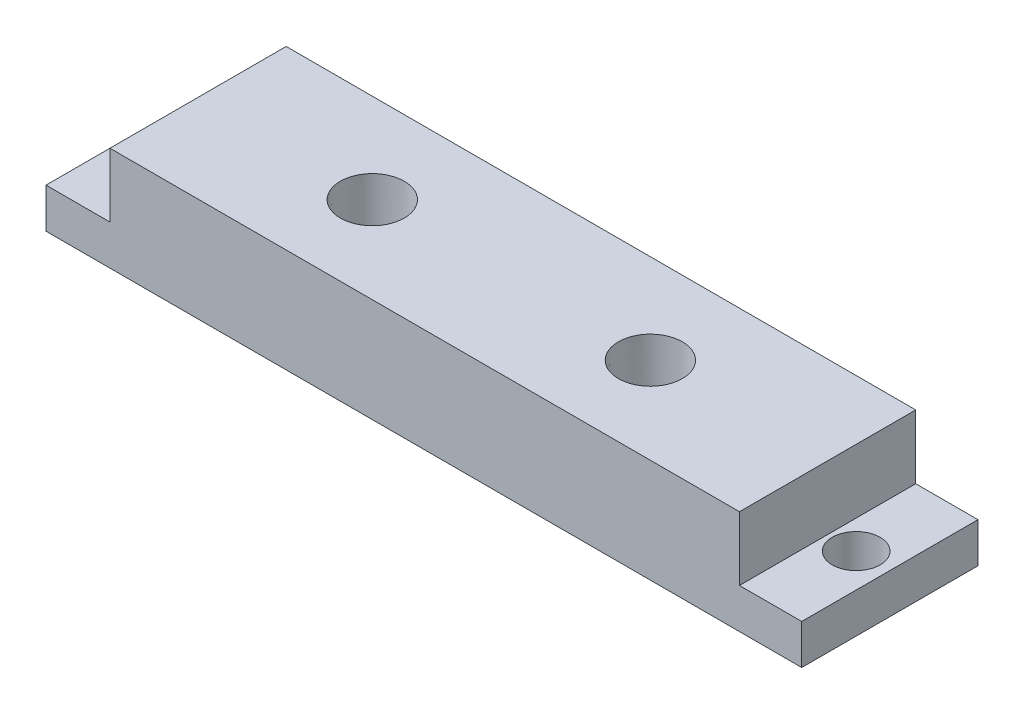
from build123d import *

# Parameters (mm, degrees)
SKETCH1_W                    = 78.604578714
SKETCH1_H                    = 22.067289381
SKETCH1_W_2                  = 8
SKETCH1_R                    = 3.036232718
SKETCH1_R_2                  = 3
BOSS_EXTRUDE6_DEPTH          = 13
CUT_EXTRUDE1_START           = -8
SKETCH2_W                    = 8
SKETCH2_H                    = 22.067289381
SKETCH2_R                    = 3.036232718
CUT_EXTRUDE1_DEPTH           = 8
SKETCH4_W                    = 8
SKETCH4_H                    = 22.067289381
CUT_EXTRUDE2_DEPTH           = 8
SKETCH5_R                    = 4
CUT_EXTRUDE4_DEPTH           = 10
CUT_EXTRUDE4_DRAFT           = -1
CUT_EXTRUDE4_PROFILE_2_DEPTH = 10
CUT_EXTRUDE4_PROFILE_2_DRAFT = -1


with BuildPart() as part:
    # Sketch1 → Boss-Extrude6 (new body)
    # profile 1 of 3: a face of its own
    with BuildSketch(Plane(origin=(0, 0, 0), x_dir=(1, 0, 0), z_dir=(0, 1, 0))):
        with Locations((-37.000862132, -7.221309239)):
            Rectangle(SKETCH1_W, SKETCH1_H)
    # profile 2 of 3: a face of its own
    with BuildSketch(Plane(origin=(0, 0, 0), x_dir=(1, 0, 0), z_dir=(0, 1, 0))):
        with Locations((-80.303151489, -7.221309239)):
            Rectangle(SKETCH1_W_2, SKETCH1_H)
        with Locations(Location((-80.183749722, -7.221309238, 0), (0, 0, 90))):
            Circle(SKETCH1_R, mode=Mode.SUBTRACT)
    # profile 3 of 3: a face of its own
    with BuildSketch(Plane(origin=(0, 0, 0), x_dir=(1, 0, 0), z_dir=(0, 1, 0))):
        with Locations((6.301427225, -7.221309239)):
            Rectangle(SKETCH1_W_2, SKETCH1_H)
        with Locations(Location((6.081369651, -7.221309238, 0), (0, 0, 90))):
            Circle(SKETCH1_R_2, mode=Mode.SUBTRACT)
    extrude(amount=BOSS_EXTRUDE6_DEPTH)

    # Sketch2 → Cut-Extrude1 (cut)
    with BuildSketch(Plane(origin=(0, 13, 0), x_dir=(1, 0, 0), z_dir=(0, 1, 0)).offset(CUT_EXTRUDE1_START)):
        with Locations((-80.303151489, -7.221309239)):
            Rectangle(SKETCH2_W, SKETCH2_H)
        with Locations(Location((-80.183749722, -7.221309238, 0), (0, 0, 90))):
            Circle(SKETCH2_R, mode=Mode.SUBTRACT)
    extrude(amount=CUT_EXTRUDE1_DEPTH, mode=Mode.SUBTRACT)

    # Sketch4 → Cut-Extrude2 (cut)
    with BuildSketch(Plane(origin=(0, 13, 0), x_dir=(1, 0, 0), z_dir=(0, 1, 0))):
        with Locations((6.507155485, -7.221309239)):
            Rectangle(SKETCH4_W, SKETCH4_H)
    extrude(amount=-CUT_EXTRUDE2_DEPTH, mode=Mode.SUBTRACT)


with BuildPart() as cut_extrude4_tool:
    # Sketch5 → Cut-Extrude4 (with draft: the straight prism first)
    with BuildSketch(Plane(origin=(0, 13, 0), x_dir=(1, 0, 0), z_dir=(0, 1, 0))):
        with Locations((-54.303151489, -7.407638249)):
            Circle(SKETCH5_R)
    extrude(amount=-CUT_EXTRUDE4_DEPTH)
    # Cut-Extrude4: the draft: its side faces are tilted about the plane it starts from
    cut_extrude4_sides = [cut_extrude4_tool.faces().sort_by_distance(p)[0] for p in [
        (-58.303151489, 8, 7.407638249),
    ]]
    draft(cut_extrude4_sides, Plane(origin=(0, 13, 0), x_dir=(1, 0, 0), z_dir=(0, 1, 0)), CUT_EXTRUDE4_DRAFT)


with BuildPart() as part_1:
    add(part.part)

    # Cut-Extrude4: cut by cut_extrude4_tool
    add(cut_extrude4_tool.part, mode=Mode.SUBTRACT)


with BuildPart() as cut_extrude4_profile_2_tool:
    # Sketch5 → Cut-Extrude4 profile 2 (with draft: the straight prism first)
    with BuildSketch(Plane(origin=(0, 13, 0), x_dir=(1, 0, 0), z_dir=(0, 1, 0))):
        with Locations((-19.492844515, -7.407638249)):
            Circle(SKETCH5_R)
    extrude(amount=-CUT_EXTRUDE4_PROFILE_2_DEPTH)
    # Cut-Extrude4 profile 2: the draft: its side faces are tilted about the plane it starts from
    cut_extrude4_profile_2_sides = [cut_extrude4_profile_2_tool.faces().sort_by_distance(p)[0] for p in [
        (-23.492844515, 8, 7.407638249),
    ]]
    draft(cut_extrude4_profile_2_sides, Plane(origin=(0, 13, 0), x_dir=(1, 0, 0), z_dir=(0, 1, 0)), CUT_EXTRUDE4_PROFILE_2_DRAFT)


with BuildPart() as part_2:
    add(part_1.part)

    # Cut-Extrude4 profile 2: cut by cut_extrude4_profile_2_tool
    add(cut_extrude4_profile_2_tool.part, mode=Mode.SUBTRACT)


solid = part_2.part
